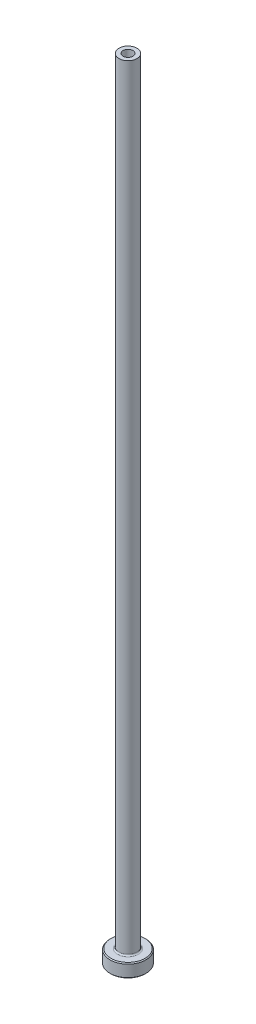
ISO-10303-21;
HEADER;
FILE_DESCRIPTION(('STEP AP214'),'2;1');
FILE_NAME('part.step','',(''),(''),'','','');
FILE_SCHEMA(('AUTOMOTIVE_DESIGN { 1 0 10303 214 1 1 1 1 }'));
ENDSEC;
DATA;
#1=APPLICATION_CONTEXT('core data for automotive mechanical design processes');
#2=APPLICATION_PROTOCOL_DEFINITION('international standard','automotive_design',2000,#1);
#3=PRODUCT_CONTEXT('',#1,'mechanical');
#4=PRODUCT('Part','Part','',(#3));
#5=PRODUCT_RELATED_PRODUCT_CATEGORY('part','',(#4));
#6=PRODUCT_DEFINITION_FORMATION('','',#4);
#7=PRODUCT_DEFINITION_CONTEXT('part definition',#1,'design');
#8=PRODUCT_DEFINITION('design','',#6,#7);
#9=PRODUCT_DEFINITION_SHAPE('','',#8);
#10=(LENGTH_UNIT() NAMED_UNIT(*) SI_UNIT(.MILLI.,.METRE.));
#11=(NAMED_UNIT(*) PLANE_ANGLE_UNIT() SI_UNIT($,.RADIAN.));
#12=(NAMED_UNIT(*) SI_UNIT($,.STERADIAN.) SOLID_ANGLE_UNIT());
#13=UNCERTAINTY_MEASURE_WITH_UNIT(LENGTH_MEASURE(1.E-05),#10,'distance_accuracy_value','');
#14=(GEOMETRIC_REPRESENTATION_CONTEXT(3) GLOBAL_UNCERTAINTY_ASSIGNED_CONTEXT((#13)) GLOBAL_UNIT_ASSIGNED_CONTEXT((#10,
#11,#12)) REPRESENTATION_CONTEXT('',''));
#15=CARTESIAN_POINT('',(0.,0.,0.));
#16=DIRECTION('',(0.,0.,1.));
#17=DIRECTION('',(1.,0.,0.));
#18=AXIS2_PLACEMENT_3D('',#15,#16,#17);
#19=CARTESIAN_POINT('',(0.,92.1876809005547,0.));
#20=DIRECTION('',(0.,1.,0.));
#21=DIRECTION('',(0.,0.,1.));
#22=AXIS2_PLACEMENT_3D('',#19,#20,#21);
#23=CYLINDRICAL_SURFACE('',#22,1.1);
#24=CARTESIAN_POINT('',(0.,175.,0.));
#25=DIRECTION('',(0.,1.,0.));
#26=DIRECTION('',(0.,0.,1.));
#27=AXIS2_PLACEMENT_3D('',#24,#25,#26);
#28=CIRCLE('',#27,1.1);
#29=CARTESIAN_POINT('',(0.,175.,1.1));
#30=VERTEX_POINT('',#29);
#31=EDGE_CURVE('E62',#30,#30,#28,.T.);
#32=ORIENTED_EDGE('',*,*,#31,.T.);
#33=EDGE_LOOP('',(#32));
#34=FACE_BOUND('',#33,.T.);
#35=CARTESIAN_POINT('',(0.,140.,0.));
#36=DIRECTION('',(0.,1.,0.));
#37=DIRECTION('',(0.,0.,1.));
#38=AXIS2_PLACEMENT_3D('',#35,#36,#37);
#39=CIRCLE('',#38,1.1);
#40=CARTESIAN_POINT('',(0.,140.,1.1));
#41=VERTEX_POINT('',#40);
#42=EDGE_CURVE('E71',#41,#41,#39,.T.);
#43=ORIENTED_EDGE('',*,*,#42,.F.);
#44=EDGE_LOOP('',(#43));
#45=FACE_BOUND('',#44,.T.);
#46=ADVANCED_FACE('F30',(#34,#45),#23,.F.);
#47=CARTESIAN_POINT('',(-1.1,175.,0.));
#48=DIRECTION('',(0.,1.,0.));
#49=DIRECTION('',(0.,0.,1.));
#50=AXIS2_PLACEMENT_3D('',#47,#48,#49);
#51=PLANE('',#50);
#52=CARTESIAN_POINT('',(0.,175.,0.));
#53=DIRECTION('',(0.,1.,0.));
#54=DIRECTION('',(0.,0.,1.));
#55=AXIS2_PLACEMENT_3D('',#52,#53,#54);
#56=CIRCLE('',#55,2.00000000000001);
#57=CARTESIAN_POINT('',(0.,175.,2.00000000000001));
#58=VERTEX_POINT('',#57);
#59=EDGE_CURVE('E65',#58,#58,#56,.T.);
#60=ORIENTED_EDGE('',*,*,#59,.T.);
#61=EDGE_LOOP('',(#60));
#62=FACE_BOUND('',#61,.T.);
#63=ORIENTED_EDGE('',*,*,#31,.F.);
#64=EDGE_LOOP('',(#63));
#65=FACE_BOUND('',#64,.T.);
#66=ADVANCED_FACE('F79',(#62,#65),#51,.T.);
#67=CARTESIAN_POINT('',(0.,92.1876809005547,0.));
#68=DIRECTION('',(0.,1.,0.));
#69=DIRECTION('',(0.,0.,1.));
#70=AXIS2_PLACEMENT_3D('',#67,#68,#69);
#71=CYLINDRICAL_SURFACE('',#70,2.);
#72=CARTESIAN_POINT('',(0.,3.3,0.));
#73=DIRECTION('',(0.,1.,0.));
#74=DIRECTION('',(0.,0.,1.));
#75=AXIS2_PLACEMENT_3D('',#72,#73,#74);
#76=CIRCLE('',#75,2.);
#77=CARTESIAN_POINT('',(0.,3.3,2.));
#78=VERTEX_POINT('',#77);
#79=EDGE_CURVE('E59',#78,#78,#76,.T.);
#80=ORIENTED_EDGE('',*,*,#79,.T.);
#81=EDGE_LOOP('',(#80));
#82=FACE_BOUND('',#81,.T.);
#83=ORIENTED_EDGE('',*,*,#59,.F.);
#84=EDGE_LOOP('',(#83));
#85=FACE_BOUND('',#84,.T.);
#86=ADVANCED_FACE('F85',(#82,#85),#71,.T.);
#87=CARTESIAN_POINT('',(-1.99999999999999,3.,0.));
#88=DIRECTION('',(0.,1.,0.));
#89=DIRECTION('',(0.,0.,1.));
#90=AXIS2_PLACEMENT_3D('',#87,#88,#89);
#91=PLANE('',#90);
#92=CARTESIAN_POINT('',(0.,3.,0.));
#93=DIRECTION('',(0.,1.,0.));
#94=DIRECTION('',(0.,0.,1.));
#95=AXIS2_PLACEMENT_3D('',#92,#93,#94);
#96=CIRCLE('',#95,3.79999999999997);
#97=CARTESIAN_POINT('',(0.,3.,3.79999999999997));
#98=VERTEX_POINT('',#97);
#99=EDGE_CURVE('E53',#98,#98,#96,.T.);
#100=ORIENTED_EDGE('',*,*,#99,.T.);
#101=EDGE_LOOP('',(#100));
#102=FACE_BOUND('',#101,.T.);
#103=CARTESIAN_POINT('',(0.,3.,0.));
#104=DIRECTION('',(0.,1.,0.));
#105=DIRECTION('',(0.,0.,1.));
#106=AXIS2_PLACEMENT_3D('',#103,#104,#105);
#107=CIRCLE('',#106,2.3);
#108=CARTESIAN_POINT('',(0.,3.,2.3));
#109=VERTEX_POINT('',#108);
#110=EDGE_CURVE('E56',#109,#109,#107,.F.);
#111=ORIENTED_EDGE('',*,*,#110,.T.);
#112=EDGE_LOOP('',(#111));
#113=FACE_BOUND('',#112,.T.);
#114=ADVANCED_FACE('F111',(#102,#113),#91,.T.);
#115=CARTESIAN_POINT('',(0.,92.1876809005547,0.));
#116=DIRECTION('',(0.,1.,0.));
#117=DIRECTION('',(0.,0.,1.));
#118=AXIS2_PLACEMENT_3D('',#115,#116,#117);
#119=CYLINDRICAL_SURFACE('',#118,3.99999999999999);
#120=CARTESIAN_POINT('',(0.,2.79999999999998,0.));
#121=DIRECTION('',(0.,1.,0.));
#122=DIRECTION('',(0.,0.,1.));
#123=AXIS2_PLACEMENT_3D('',#120,#121,#122);
#124=CIRCLE('',#123,3.99999999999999);
#125=CARTESIAN_POINT('',(0.,2.79999999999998,3.99999999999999));
#126=VERTEX_POINT('',#125);
#127=EDGE_CURVE('E45',#126,#126,#124,.F.);
#128=ORIENTED_EDGE('',*,*,#127,.T.);
#129=EDGE_LOOP('',(#128));
#130=FACE_BOUND('',#129,.T.);
#131=CARTESIAN_POINT('',(0.,0.199999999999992,0.));
#132=DIRECTION('',(0.,-1.,0.));
#133=DIRECTION('',(0.,0.,-1.));
#134=AXIS2_PLACEMENT_3D('',#131,#132,#133);
#135=CIRCLE('',#134,3.99999999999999);
#136=CARTESIAN_POINT('',(0.,0.199999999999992,-3.99999999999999));
#137=VERTEX_POINT('',#136);
#138=EDGE_CURVE('E50',#137,#137,#135,.F.);
#139=ORIENTED_EDGE('',*,*,#138,.T.);
#140=EDGE_LOOP('',(#139));
#141=FACE_BOUND('',#140,.T.);
#142=ADVANCED_FACE('F108',(#130,#141),#119,.T.);
#143=CARTESIAN_POINT('',(-3.99999999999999,0.,0.));
#144=DIRECTION('',(0.,-1.,0.));
#145=DIRECTION('',(0.,0.,-1.));
#146=AXIS2_PLACEMENT_3D('',#143,#144,#145);
#147=PLANE('',#146);
#148=CARTESIAN_POINT('',(0.,0.,0.));
#149=DIRECTION('',(0.,-1.,0.));
#150=DIRECTION('',(0.,0.,-1.));
#151=AXIS2_PLACEMENT_3D('',#148,#149,#150);
#152=CIRCLE('',#151,1.84999999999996);
#153=CARTESIAN_POINT('',(0.,0.,-1.84999999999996));
#154=VERTEX_POINT('',#153);
#155=EDGE_CURVE('E37',#154,#154,#152,.F.);
#156=ORIENTED_EDGE('',*,*,#155,.T.);
#157=EDGE_LOOP('',(#156));
#158=FACE_BOUND('',#157,.T.);
#159=CARTESIAN_POINT('',(0.,0.,0.));
#160=DIRECTION('',(0.,-1.,0.));
#161=DIRECTION('',(0.,0.,-1.));
#162=AXIS2_PLACEMENT_3D('',#159,#160,#161);
#163=CIRCLE('',#162,3.8);
#164=CARTESIAN_POINT('',(0.,0.,-3.8));
#165=VERTEX_POINT('',#164);
#166=EDGE_CURVE('E41',#165,#165,#163,.T.);
#167=ORIENTED_EDGE('',*,*,#166,.T.);
#168=EDGE_LOOP('',(#167));
#169=FACE_BOUND('',#168,.T.);
#170=ADVANCED_FACE('F110',(#158,#169),#147,.T.);
#171=CARTESIAN_POINT('',(0.,92.1876809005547,0.));
#172=DIRECTION('',(0.,1.,0.));
#173=DIRECTION('',(0.,0.,1.));
#174=AXIS2_PLACEMENT_3D('',#171,#172,#173);
#175=CYLINDRICAL_SURFACE('',#174,1.35);
#176=CARTESIAN_POINT('',(0.,0.499999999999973,0.));
#177=DIRECTION('',(0.,-1.,0.));
#178=DIRECTION('',(0.,0.,-1.));
#179=AXIS2_PLACEMENT_3D('',#176,#177,#178);
#180=CIRCLE('',#179,1.35);
#181=CARTESIAN_POINT('',(0.,0.499999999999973,-1.35));
#182=VERTEX_POINT('',#181);
#183=EDGE_CURVE('E10',#182,#182,#180,.T.);
#184=ORIENTED_EDGE('',*,*,#183,.T.);
#185=EDGE_LOOP('',(#184));
#186=FACE_BOUND('',#185,.T.);
#187=CARTESIAN_POINT('',(0.,128.,0.));
#188=DIRECTION('',(0.,1.,0.));
#189=DIRECTION('',(0.,0.,1.));
#190=AXIS2_PLACEMENT_3D('',#187,#188,#189);
#191=CIRCLE('',#190,1.35000000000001);
#192=CARTESIAN_POINT('',(0.,128.,1.35000000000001));
#193=VERTEX_POINT('',#192);
#194=EDGE_CURVE('E68',#193,#193,#191,.T.);
#195=ORIENTED_EDGE('',*,*,#194,.T.);
#196=EDGE_LOOP('',(#195));
#197=FACE_BOUND('',#196,.T.);
#198=ADVANCED_FACE('F118',(#186,#197),#175,.F.);
#199=CARTESIAN_POINT('',(0.,128.,0.));
#200=DIRECTION('',(0.,-1.,0.));
#201=DIRECTION('',(0.,0.,-1.));
#202=AXIS2_PLACEMENT_3D('',#199,#200,#201);
#203=CONICAL_SURFACE('',#202,1.35000000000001,0.0208303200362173);
#204=ORIENTED_EDGE('',*,*,#42,.T.);
#205=EDGE_LOOP('',(#204));
#206=FACE_BOUND('',#205,.T.);
#207=ORIENTED_EDGE('',*,*,#194,.F.);
#208=EDGE_LOOP('',(#207));
#209=FACE_BOUND('',#208,.T.);
#210=ADVANCED_FACE('F75',(#206,#209),#203,.F.);
#211=CARTESIAN_POINT('',(0.,3.3,0.));
#212=DIRECTION('',(0.,1.,0.));
#213=DIRECTION('',(0.,0.,1.));
#214=AXIS2_PLACEMENT_3D('',#211,#212,#213);
#215=TOROIDAL_SURFACE('',#214,2.3,0.3);
#216=ORIENTED_EDGE('',*,*,#110,.F.);
#217=EDGE_LOOP('',(#216));
#218=FACE_BOUND('',#217,.T.);
#219=ORIENTED_EDGE('',*,*,#79,.F.);
#220=EDGE_LOOP('',(#219));
#221=FACE_BOUND('',#220,.T.);
#222=ADVANCED_FACE('F90',(#218,#221),#215,.F.);
#223=CARTESIAN_POINT('',(0.,3.,0.));
#224=DIRECTION('',(0.,-1.,0.));
#225=DIRECTION('',(0.,0.,-1.));
#226=AXIS2_PLACEMENT_3D('',#223,#224,#225);
#227=CONICAL_SURFACE('',#226,3.79999999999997,0.785398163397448);
#228=ORIENTED_EDGE('',*,*,#127,.F.);
#229=EDGE_LOOP('',(#228));
#230=FACE_BOUND('',#229,.T.);
#231=ORIENTED_EDGE('',*,*,#99,.F.);
#232=EDGE_LOOP('',(#231));
#233=FACE_BOUND('',#232,.T.);
#234=ADVANCED_FACE('F93',(#230,#233),#227,.T.);
#235=CARTESIAN_POINT('',(0.,0.199999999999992,0.));
#236=DIRECTION('',(0.,1.,0.));
#237=DIRECTION('',(0.,0.,1.));
#238=AXIS2_PLACEMENT_3D('',#235,#236,#237);
#239=CONICAL_SURFACE('',#238,3.99999999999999,0.785398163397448);
#240=ORIENTED_EDGE('',*,*,#166,.F.);
#241=EDGE_LOOP('',(#240));
#242=FACE_BOUND('',#241,.T.);
#243=ORIENTED_EDGE('',*,*,#138,.F.);
#244=EDGE_LOOP('',(#243));
#245=FACE_BOUND('',#244,.T.);
#246=ADVANCED_FACE('F96',(#242,#245),#239,.T.);
#247=CARTESIAN_POINT('',(0.,0.,0.));
#248=DIRECTION('',(0.,-1.,0.));
#249=DIRECTION('',(0.,0.,-1.));
#250=AXIS2_PLACEMENT_3D('',#247,#248,#249);
#251=CONICAL_SURFACE('',#250,1.84999999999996,0.78539816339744);
#252=ORIENTED_EDGE('',*,*,#183,.F.);
#253=EDGE_LOOP('',(#252));
#254=FACE_BOUND('',#253,.T.);
#255=ORIENTED_EDGE('',*,*,#155,.F.);
#256=EDGE_LOOP('',(#255));
#257=FACE_BOUND('',#256,.T.);
#258=ADVANCED_FACE('F32',(#254,#257),#251,.F.);
#259=CLOSED_SHELL('',(#46,#66,#86,#114,#142,#170,#198,#210,#222,#234,#246,#258));
#260=MANIFOLD_SOLID_BREP('B2',#259);
#261=ADVANCED_BREP_SHAPE_REPRESENTATION('',(#18,#260),#14);
#262=SHAPE_DEFINITION_REPRESENTATION(#9,#261);
ENDSEC;
END-ISO-10303-21;
